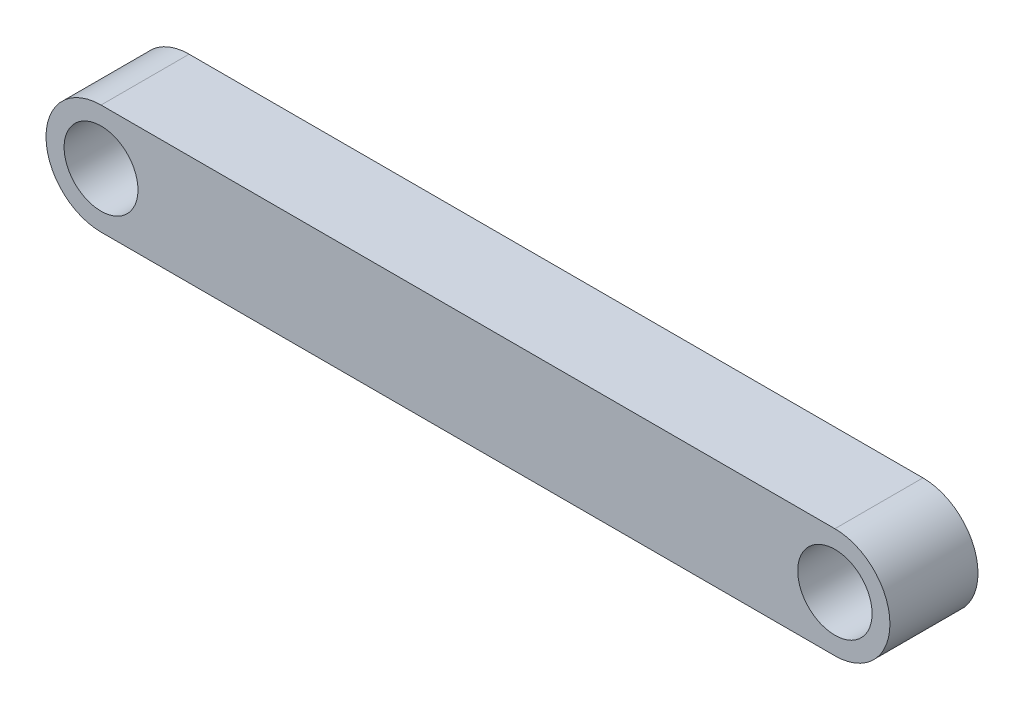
from build123d import *

# Parameters (mm, degrees)
SKETCH1_R      = 6.435400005
SKETCH1_R_2    = 6.390584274
EXTRUDE1_DEPTH = 15.24


with BuildPart() as part:
    # Sketch1 → Extrude1 (new body)
    with BuildSketch(Plane.XY):
        with BuildLine():
            Line((0, 0), (127, 0))
            ThreePointArc((127, 0), (136.525, 9.525), (127, 19.05))
            Line((127, 19.05), (0, 19.05))
            ThreePointArc((0, 19.05), (-9.525, 9.525), (0, 0))
        make_face()
        with Locations((127, 9.525)):
            Circle(SKETCH1_R, mode=Mode.SUBTRACT)
        with Locations((0, 9.525)):
            Circle(SKETCH1_R_2, mode=Mode.SUBTRACT)
    extrude(amount=EXTRUDE1_DEPTH)


solid = part.part
